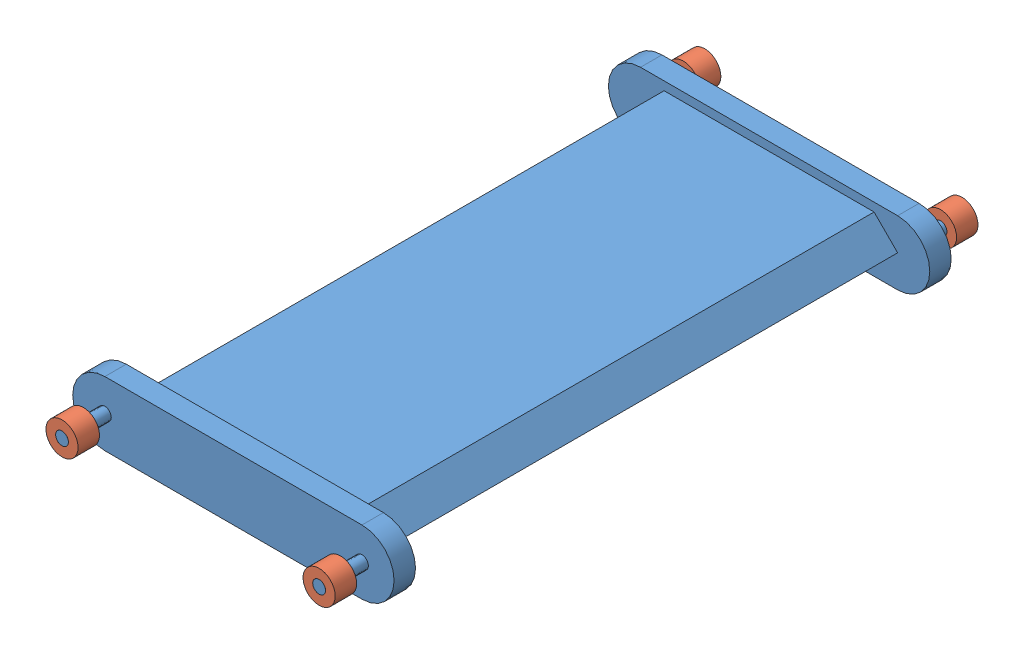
SolidWorks assembly plate.sldasm, configuration Default (file format 11000). Lengths in mm.
Overall size (190.5 38.1 381).
5 component instances, 2 part files, 2 mates.
Components (placement in the parent):
- plate2-1: plate2.SLDPRT [Default] at (-343.681 273.5692 152.4) size (190.5 38.1 381)
- wheel-1: wheel.SLDPRT [Default] at (-419.881 273.5692 190.5) size (19.05 19.05 12.7)
- wheel-2: wheel.SLDPRT [Default] at (-267.481 273.5692 190.5) size (19.05 19.05 12.7)
- wheel-3: wheel.SLDPRT [Default] at (-419.881 273.5692 -177.8) size (19.05 19.05 12.7)
- wheel-4: wheel.SLDPRT [Default] at (-267.481 273.5692 -177.8) size (19.05 19.05 12.7)
Mates (geometry in assembly coordinates):
- Concentric1: concentric: cylinder of assembly; cylinder of assembly; cylinder of plate2-1 through (-419.881 273.5692 190.5) axis (0 0 -1) radius 3.81; cylinder of wheel-1 through (-419.881 273.5692 177.8) axis (0 0 1) radius 3.81
- Coincident1: coincident: plane of assembly; plane of assembly; plane of plate2-1 through (-419.881 273.5692 190.5) normal (0 0 1); plane of wheel-1 through (-419.881 273.5692 190.5) normal (0 0 1)
